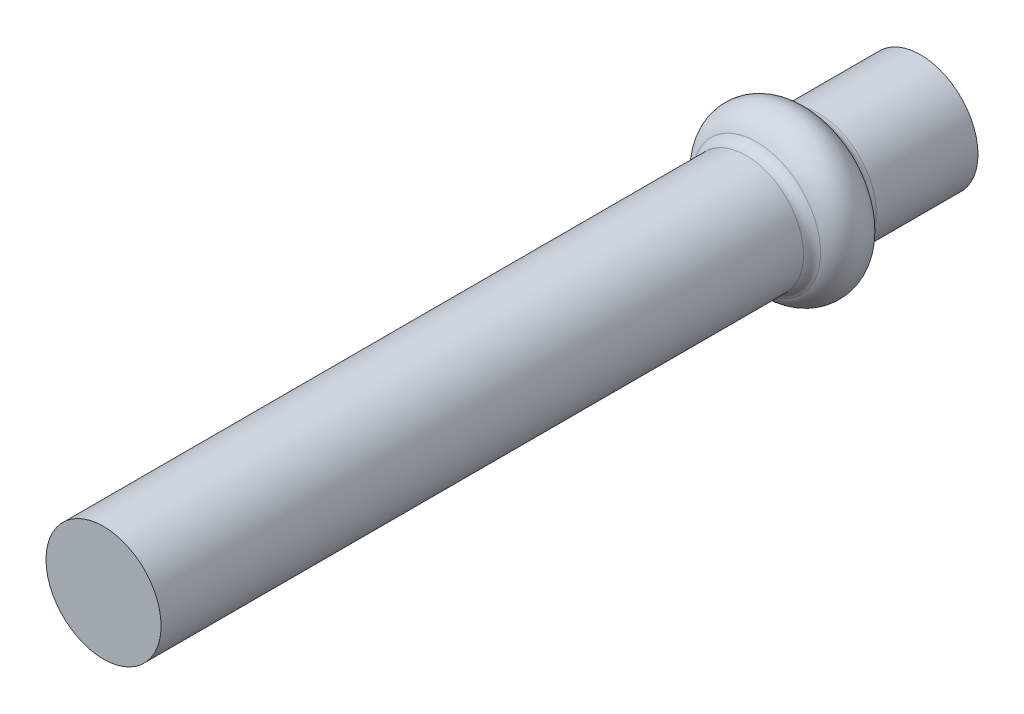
from build123d import *

# Parameters (mm, degrees)
ESQUISSE1_R          = 5
BASE_EXTRUSION_DEPTH = 71
CONG_1_R             = 1
CONG_2_R             = 1


with BuildPart() as part:
    # Esquisse1 → Base-Extrusion (new body)
    with BuildSketch(Plane.XY):
        Circle(ESQUISSE1_R)
    extrude(amount=BASE_EXTRUSION_DEPTH)

    # Esquisse4 → Boss.-R_vol.1 (revolve)
    with BuildSketch(Plane(origin=(0, 0, 0), x_dir=(0, 0, -1), z_dir=(1, 0, 0)), mode=Mode.PRIVATE) as boss_r_vol_1_sk:
        with BuildLine():
            Line((-14.449489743, 5), (-9.550510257, 5))
            ThreePointArc((-9.550510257, 5), (-12, 7), (-14.449489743, 5))
        make_face()
    revolve(boss_r_vol_1_sk.sketch.rotate(Axis((0, 0, 0), (0, 0, 1)), 90), axis=Axis((0, 0, 0), (0, 0, 1)))

    # Cong_1
    cong_1_edges = [part.edges().sort_by_distance(p)[0] for p in [
        (0, -5, 14.449489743),
    ]]
    fillet(cong_1_edges, radius=CONG_1_R)

    # Cong_2
    cong_2_edges = [part.edges().sort_by_distance(p)[0] for p in [
        (0, -5, 9.550510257),
    ]]
    fillet(cong_2_edges, radius=CONG_2_R)

    # Esquisse5 → Enl_vement de mati_re-R_volution1 (revolve, cut)
    with BuildSketch(Plane(origin=(0, 0, 0), x_dir=(0, 0, -1), z_dir=(1, 0, 0)), mode=Mode.PRIVATE) as enl_vement_de_mati_re_r_volution1_sk:
        with BuildLine():
            Line((-15.16227766, 4), (-61, 4))
            ThreePointArc((-61, 4), (-63.828427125, 2.828427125), (-65, 0))
            Line((-65, 0), (0, 0))
            Line((0, 0), (0, 4))
            Line((0, 4), (-8.83772234, 4))
            ThreePointArc((-8.83772234, 4), (-9.906767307, 4.309691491), (-10.644738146, 5.142857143))
            ThreePointArc((-10.644738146, 5.142857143), (-12, 6), (-13.355261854, 5.142857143))
            ThreePointArc((-13.355261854, 5.142857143), (-14.093232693, 4.309691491), (-15.16227766, 4))
        make_face()
    revolve(enl_vement_de_mati_re_r_volution1_sk.sketch.rotate(Axis((0, 0, 71), (0, 0, -1)), 90), axis=Axis((0, 0, 71), (0, 0, -1)), mode=Mode.SUBTRACT)


solid = part.part
